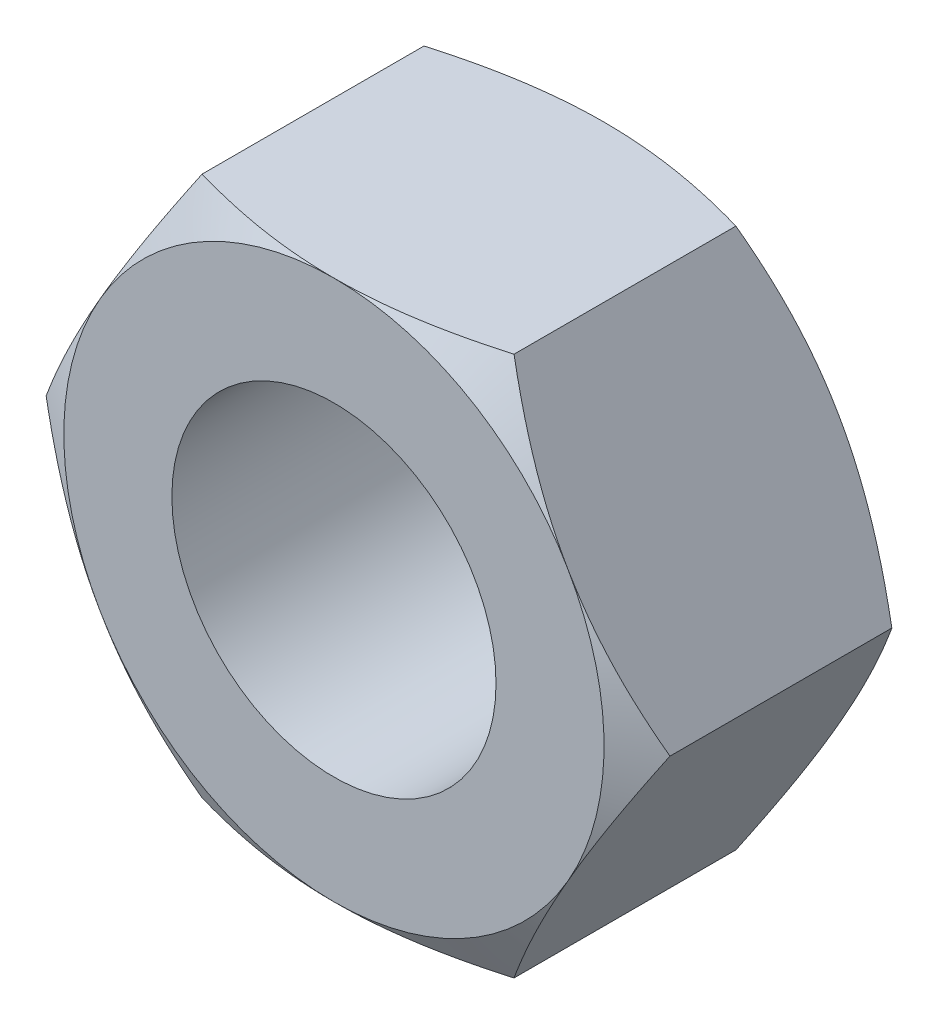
from build123d import *

# Parameters (mm, degrees)
BASE_EXTRUSION_DEPTH      = 2.5
BASE_EXTRUSION_DEPTH_BACK = 2.5
PER_AGE1_D                = 6


with BuildPart() as part:
    # Esquisse1 → Base-Extrusion (new, two sides: drawn at the far end of the back side and taken through both)
    with BuildSketch(Plane.XY.offset(-BASE_EXTRUSION_DEPTH_BACK)):
        Polygon((-2.886751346, 5), (2.886751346, 5), (5.773502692, 0), (2.886751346, -5), (-2.886751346, -5), (-5.773502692, 0), align=None)
    extrude(amount=BASE_EXTRUSION_DEPTH + BASE_EXTRUSION_DEPTH_BACK)

    # Per_age1 (through all)
    with Locations(Plane(origin=(0, 0, -2.5), x_dir=(-1, 0, 0), z_dir=(0, 0, -1))):
        with Locations((0, 0)):
            Hole(PER_AGE1_D / 2)

    # Esquisse5 → Enl_vement de mati_re-R_volution1 (revolve, cut)
    with BuildSketch(Plane(origin=(0, 0, 0), x_dir=(1, 0, 0), z_dir=(0, 1, 0)), mode=Mode.PRIVATE) as enl_vement_de_mati_re_r_volution1_sk:
        Polygon((5.773502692, 2.053418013), (5.773502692, 2.5), (5, 2.5), align=None)
    enl_vement_de_mati_re_r_volution1 = revolve(enl_vement_de_mati_re_r_volution1_sk.sketch.rotate(Axis((0, 0, -2.5), (0, 0, 1)), 180), axis=Axis((0, 0, -2.5), (0, 0, 1)), mode=Mode.SUBTRACT)

    # Sym_trie1: Enl_vement de mati_re-R_volution1 across plane
    add(enl_vement_de_mati_re_r_volution1.mirror(Plane.XY), mode=Mode.SUBTRACT)


solid = part.part
